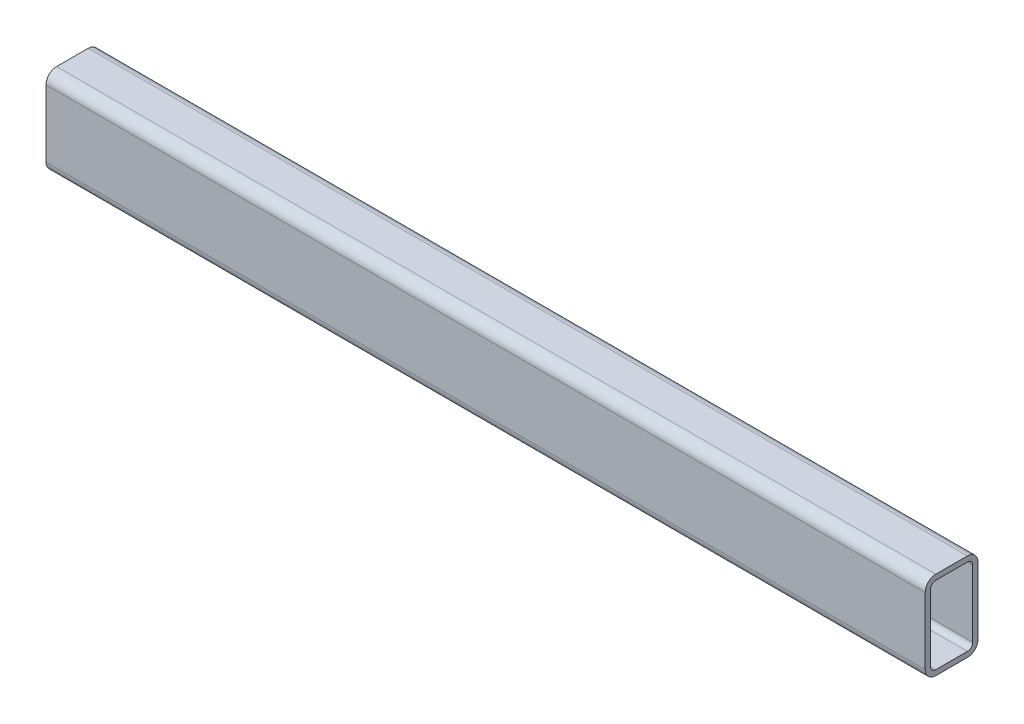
ISO-10303-21;
HEADER;
FILE_DESCRIPTION(('STEP AP214'),'2;1');
FILE_NAME('part.step','',(''),(''),'','','');
FILE_SCHEMA(('AUTOMOTIVE_DESIGN { 1 0 10303 214 1 1 1 1 }'));
ENDSEC;
DATA;
#1=APPLICATION_CONTEXT('core data for automotive mechanical design processes');
#2=APPLICATION_PROTOCOL_DEFINITION('international standard','automotive_design',2000,#1);
#3=PRODUCT_CONTEXT('',#1,'mechanical');
#4=PRODUCT('Part','Part','',(#3));
#5=PRODUCT_RELATED_PRODUCT_CATEGORY('part','',(#4));
#6=PRODUCT_DEFINITION_FORMATION('','',#4);
#7=PRODUCT_DEFINITION_CONTEXT('part definition',#1,'design');
#8=PRODUCT_DEFINITION('design','',#6,#7);
#9=PRODUCT_DEFINITION_SHAPE('','',#8);
#10=(LENGTH_UNIT() NAMED_UNIT(*) SI_UNIT(.MILLI.,.METRE.));
#11=(NAMED_UNIT(*) PLANE_ANGLE_UNIT() SI_UNIT($,.RADIAN.));
#12=(NAMED_UNIT(*) SI_UNIT($,.STERADIAN.) SOLID_ANGLE_UNIT());
#13=UNCERTAINTY_MEASURE_WITH_UNIT(LENGTH_MEASURE(1.E-05),#10,'distance_accuracy_value','');
#14=(GEOMETRIC_REPRESENTATION_CONTEXT(3) GLOBAL_UNCERTAINTY_ASSIGNED_CONTEXT((#13)) GLOBAL_UNIT_ASSIGNED_CONTEXT((#10,
#11,#12)) REPRESENTATION_CONTEXT('',''));
#15=CARTESIAN_POINT('',(0.,0.,0.));
#16=DIRECTION('',(0.,0.,1.));
#17=DIRECTION('',(1.,0.,0.));
#18=AXIS2_PLACEMENT_3D('',#15,#16,#17);
#19=CARTESIAN_POINT('',(250.,-19.,9.));
#20=DIRECTION('',(-1.,0.,0.));
#21=DIRECTION('',(0.,0.,1.));
#22=AXIS2_PLACEMENT_3D('',#19,#20,#21);
#23=CYLINDRICAL_SURFACE('',#22,3.);
#24=CARTESIAN_POINT('',(-250.,-19.,9.));
#25=DIRECTION('',(1.,0.,0.));
#26=DIRECTION('',(0.,0.,1.));
#27=AXIS2_PLACEMENT_3D('',#24,#25,#26);
#28=CIRCLE('',#27,3.);
#29=CARTESIAN_POINT('',(-250.,-19.,12.));
#30=VERTEX_POINT('',#29);
#31=CARTESIAN_POINT('',(-250.,-22.,9.));
#32=VERTEX_POINT('',#31);
#33=EDGE_CURVE('E189',#30,#32,#28,.T.);
#34=ORIENTED_EDGE('',*,*,#33,.F.);
#35=DIRECTION('',(-1.,0.,0.));
#36=VECTOR('',#35,1.);
#37=CARTESIAN_POINT('',(250.,-19.,12.));
#38=LINE('',#37,#36);
#39=CARTESIAN_POINT('',(250.,-19.,12.));
#40=VERTEX_POINT('',#39);
#41=EDGE_CURVE('E11',#40,#30,#38,.T.);
#42=ORIENTED_EDGE('',*,*,#41,.F.);
#43=CARTESIAN_POINT('',(250.,-19.,9.));
#44=DIRECTION('',(1.,0.,0.));
#45=DIRECTION('',(0.,0.,1.));
#46=AXIS2_PLACEMENT_3D('',#43,#44,#45);
#47=CIRCLE('',#46,3.);
#48=CARTESIAN_POINT('',(250.,-22.,9.));
#49=VERTEX_POINT('',#48);
#50=EDGE_CURVE('E228',#40,#49,#47,.T.);
#51=ORIENTED_EDGE('',*,*,#50,.T.);
#52=DIRECTION('',(-1.,0.,0.));
#53=VECTOR('',#52,1.);
#54=CARTESIAN_POINT('',(250.,-22.,9.));
#55=LINE('',#54,#53);
#56=EDGE_CURVE('E54',#49,#32,#55,.T.);
#57=ORIENTED_EDGE('',*,*,#56,.T.);
#58=EDGE_LOOP('',(#34,#42,#51,#57));
#59=FACE_BOUND('',#58,.T.);
#60=ADVANCED_FACE('F37',(#59),#23,.F.);
#61=CARTESIAN_POINT('',(250.,-19.,12.));
#62=DIRECTION('',(0.,0.,-1.));
#63=DIRECTION('',(-1.,0.,0.));
#64=AXIS2_PLACEMENT_3D('',#61,#62,#63);
#65=PLANE('',#64);
#66=DIRECTION('',(0.,-1.,0.));
#67=VECTOR('',#66,1.);
#68=CARTESIAN_POINT('',(-250.,-19.,12.));
#69=LINE('',#68,#67);
#70=CARTESIAN_POINT('',(-250.,19.,12.));
#71=VERTEX_POINT('',#70);
#72=EDGE_CURVE('E192',#71,#30,#69,.T.);
#73=ORIENTED_EDGE('',*,*,#72,.F.);
#74=DIRECTION('',(-1.,0.,0.));
#75=VECTOR('',#74,1.);
#76=CARTESIAN_POINT('',(250.,19.,12.));
#77=LINE('',#76,#75);
#78=CARTESIAN_POINT('',(250.,19.,12.));
#79=VERTEX_POINT('',#78);
#80=EDGE_CURVE('E46',#79,#71,#77,.T.);
#81=ORIENTED_EDGE('',*,*,#80,.F.);
#82=DIRECTION('',(0.,-1.,0.));
#83=VECTOR('',#82,1.);
#84=CARTESIAN_POINT('',(250.,-19.,12.));
#85=LINE('',#84,#83);
#86=EDGE_CURVE('E230',#79,#40,#85,.T.);
#87=ORIENTED_EDGE('',*,*,#86,.T.);
#88=ORIENTED_EDGE('',*,*,#41,.T.);
#89=EDGE_LOOP('',(#73,#81,#87,#88));
#90=FACE_BOUND('',#89,.T.);
#91=ADVANCED_FACE('F313',(#90),#65,.T.);
#92=CARTESIAN_POINT('',(250.,19.,9.00000000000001));
#93=DIRECTION('',(-1.,0.,0.));
#94=DIRECTION('',(0.,0.,1.));
#95=AXIS2_PLACEMENT_3D('',#92,#93,#94);
#96=CYLINDRICAL_SURFACE('',#95,2.99999999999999);
#97=CARTESIAN_POINT('',(-250.,19.,9.00000000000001));
#98=DIRECTION('',(1.,0.,0.));
#99=DIRECTION('',(0.,0.,1.));
#100=AXIS2_PLACEMENT_3D('',#97,#98,#99);
#101=CIRCLE('',#100,2.99999999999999);
#102=CARTESIAN_POINT('',(-250.,22.,9.));
#103=VERTEX_POINT('',#102);
#104=EDGE_CURVE('E195',#103,#71,#101,.T.);
#105=ORIENTED_EDGE('',*,*,#104,.F.);
#106=DIRECTION('',(-1.,0.,0.));
#107=VECTOR('',#106,1.);
#108=CARTESIAN_POINT('',(250.,22.,9.));
#109=LINE('',#108,#107);
#110=CARTESIAN_POINT('',(250.,22.,9.));
#111=VERTEX_POINT('',#110);
#112=EDGE_CURVE('E257',#111,#103,#109,.T.);
#113=ORIENTED_EDGE('',*,*,#112,.F.);
#114=CARTESIAN_POINT('',(250.,19.,9.00000000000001));
#115=DIRECTION('',(1.,0.,0.));
#116=DIRECTION('',(0.,0.,1.));
#117=AXIS2_PLACEMENT_3D('',#114,#115,#116);
#118=CIRCLE('',#117,2.99999999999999);
#119=EDGE_CURVE('E233',#111,#79,#118,.T.);
#120=ORIENTED_EDGE('',*,*,#119,.T.);
#121=ORIENTED_EDGE('',*,*,#80,.T.);
#122=EDGE_LOOP('',(#105,#113,#120,#121));
#123=FACE_BOUND('',#122,.T.);
#124=ADVANCED_FACE('F319',(#123),#96,.F.);
#125=CARTESIAN_POINT('',(250.,22.,9.));
#126=DIRECTION('',(0.,-1.,0.));
#127=DIRECTION('',(0.,0.,-1.));
#128=AXIS2_PLACEMENT_3D('',#125,#126,#127);
#129=PLANE('',#128);
#130=DIRECTION('',(0.,0.,1.));
#131=VECTOR('',#130,1.);
#132=CARTESIAN_POINT('',(-250.,22.,9.));
#133=LINE('',#132,#131);
#134=CARTESIAN_POINT('',(-250.,22.,-9.));
#135=VERTEX_POINT('',#134);
#136=EDGE_CURVE('E198',#135,#103,#133,.T.);
#137=ORIENTED_EDGE('',*,*,#136,.F.);
#138=DIRECTION('',(-1.,0.,0.));
#139=VECTOR('',#138,1.);
#140=CARTESIAN_POINT('',(250.,22.,-9.));
#141=LINE('',#140,#139);
#142=CARTESIAN_POINT('',(250.,22.,-9.));
#143=VERTEX_POINT('',#142);
#144=EDGE_CURVE('E255',#143,#135,#141,.T.);
#145=ORIENTED_EDGE('',*,*,#144,.F.);
#146=DIRECTION('',(0.,0.,1.));
#147=VECTOR('',#146,1.);
#148=CARTESIAN_POINT('',(250.,22.,9.));
#149=LINE('',#148,#147);
#150=EDGE_CURVE('E236',#143,#111,#149,.T.);
#151=ORIENTED_EDGE('',*,*,#150,.T.);
#152=ORIENTED_EDGE('',*,*,#112,.T.);
#153=EDGE_LOOP('',(#137,#145,#151,#152));
#154=FACE_BOUND('',#153,.T.);
#155=ADVANCED_FACE('F452',(#154),#129,.T.);
#156=CARTESIAN_POINT('',(250.,19.,-9.00000000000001));
#157=DIRECTION('',(-1.,0.,0.));
#158=DIRECTION('',(0.,0.,1.));
#159=AXIS2_PLACEMENT_3D('',#156,#157,#158);
#160=CYLINDRICAL_SURFACE('',#159,3.);
#161=CARTESIAN_POINT('',(-250.,19.,-9.00000000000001));
#162=DIRECTION('',(1.,0.,0.));
#163=DIRECTION('',(0.,0.,1.));
#164=AXIS2_PLACEMENT_3D('',#161,#162,#163);
#165=CIRCLE('',#164,3.);
#166=CARTESIAN_POINT('',(-250.,19.,-12.));
#167=VERTEX_POINT('',#166);
#168=EDGE_CURVE('E201',#167,#135,#165,.T.);
#169=ORIENTED_EDGE('',*,*,#168,.F.);
#170=DIRECTION('',(-1.,0.,0.));
#171=VECTOR('',#170,1.);
#172=CARTESIAN_POINT('',(250.,19.,-12.));
#173=LINE('',#172,#171);
#174=CARTESIAN_POINT('',(250.,19.,-12.));
#175=VERTEX_POINT('',#174);
#176=EDGE_CURVE('E253',#175,#167,#173,.T.);
#177=ORIENTED_EDGE('',*,*,#176,.F.);
#178=CARTESIAN_POINT('',(250.,19.,-9.00000000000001));
#179=DIRECTION('',(1.,0.,0.));
#180=DIRECTION('',(0.,0.,1.));
#181=AXIS2_PLACEMENT_3D('',#178,#179,#180);
#182=CIRCLE('',#181,3.);
#183=EDGE_CURVE('E239',#175,#143,#182,.T.);
#184=ORIENTED_EDGE('',*,*,#183,.T.);
#185=ORIENTED_EDGE('',*,*,#144,.T.);
#186=EDGE_LOOP('',(#169,#177,#184,#185));
#187=FACE_BOUND('',#186,.T.);
#188=ADVANCED_FACE('F441',(#187),#160,.F.);
#189=CARTESIAN_POINT('',(250.,-19.,-12.));
#190=DIRECTION('',(0.,0.,1.));
#191=DIRECTION('',(1.,0.,0.));
#192=AXIS2_PLACEMENT_3D('',#189,#190,#191);
#193=PLANE('',#192);
#194=DIRECTION('',(0.,1.,0.));
#195=VECTOR('',#194,1.);
#196=CARTESIAN_POINT('',(-250.,-19.,-12.));
#197=LINE('',#196,#195);
#198=CARTESIAN_POINT('',(-250.,-19.,-12.));
#199=VERTEX_POINT('',#198);
#200=EDGE_CURVE('E204',#199,#167,#197,.T.);
#201=ORIENTED_EDGE('',*,*,#200,.F.);
#202=DIRECTION('',(-1.,0.,0.));
#203=VECTOR('',#202,1.);
#204=CARTESIAN_POINT('',(250.,-19.,-12.));
#205=LINE('',#204,#203);
#206=CARTESIAN_POINT('',(250.,-19.,-12.));
#207=VERTEX_POINT('',#206);
#208=EDGE_CURVE('E251',#207,#199,#205,.T.);
#209=ORIENTED_EDGE('',*,*,#208,.F.);
#210=DIRECTION('',(0.,1.,0.));
#211=VECTOR('',#210,1.);
#212=CARTESIAN_POINT('',(250.,-19.,-12.));
#213=LINE('',#212,#211);
#214=EDGE_CURVE('E242',#207,#175,#213,.T.);
#215=ORIENTED_EDGE('',*,*,#214,.T.);
#216=ORIENTED_EDGE('',*,*,#176,.T.);
#217=EDGE_LOOP('',(#201,#209,#215,#216));
#218=FACE_BOUND('',#217,.T.);
#219=ADVANCED_FACE('F431',(#218),#193,.T.);
#220=CARTESIAN_POINT('',(250.,-19.,-9.00000000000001));
#221=DIRECTION('',(-1.,0.,0.));
#222=DIRECTION('',(0.,0.,1.));
#223=AXIS2_PLACEMENT_3D('',#220,#221,#222);
#224=CYLINDRICAL_SURFACE('',#223,3.);
#225=CARTESIAN_POINT('',(-250.,-19.,-9.00000000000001));
#226=DIRECTION('',(1.,0.,0.));
#227=DIRECTION('',(0.,0.,-1.));
#228=AXIS2_PLACEMENT_3D('',#225,#226,#227);
#229=CIRCLE('',#228,3.);
#230=CARTESIAN_POINT('',(-250.,-22.,-9.00000000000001));
#231=VERTEX_POINT('',#230);
#232=EDGE_CURVE('E207',#231,#199,#229,.T.);
#233=ORIENTED_EDGE('',*,*,#232,.F.);
#234=DIRECTION('',(-1.,0.,0.));
#235=VECTOR('',#234,1.);
#236=CARTESIAN_POINT('',(250.,-22.,-9.00000000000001));
#237=LINE('',#236,#235);
#238=CARTESIAN_POINT('',(250.,-22.,-9.00000000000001));
#239=VERTEX_POINT('',#238);
#240=EDGE_CURVE('E62',#239,#231,#237,.T.);
#241=ORIENTED_EDGE('',*,*,#240,.F.);
#242=CARTESIAN_POINT('',(250.,-19.,-9.00000000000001));
#243=DIRECTION('',(1.,0.,0.));
#244=DIRECTION('',(0.,0.,-1.));
#245=AXIS2_PLACEMENT_3D('',#242,#243,#244);
#246=CIRCLE('',#245,3.);
#247=EDGE_CURVE('E245',#239,#207,#246,.T.);
#248=ORIENTED_EDGE('',*,*,#247,.T.);
#249=ORIENTED_EDGE('',*,*,#208,.T.);
#250=EDGE_LOOP('',(#233,#241,#248,#249));
#251=FACE_BOUND('',#250,.T.);
#252=ADVANCED_FACE('F423',(#251),#224,.F.);
#253=CARTESIAN_POINT('',(250.,19.,9.00000000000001));
#254=DIRECTION('',(-1.,0.,0.));
#255=DIRECTION('',(0.,0.,1.));
#256=AXIS2_PLACEMENT_3D('',#253,#254,#255);
#257=CYLINDRICAL_SURFACE('',#256,6.);
#258=CARTESIAN_POINT('',(-250.,19.,9.00000000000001));
#259=DIRECTION('',(1.,0.,0.));
#260=DIRECTION('',(0.,0.,1.));
#261=AXIS2_PLACEMENT_3D('',#258,#259,#260);
#262=CIRCLE('',#261,6.);
#263=CARTESIAN_POINT('',(-250.,25.,9.));
#264=VERTEX_POINT('',#263);
#265=CARTESIAN_POINT('',(-250.,19.,15.));
#266=VERTEX_POINT('',#265);
#267=EDGE_CURVE('E159',#264,#266,#262,.T.);
#268=ORIENTED_EDGE('',*,*,#267,.T.);
#269=DIRECTION('',(-1.,0.,0.));
#270=VECTOR('',#269,1.);
#271=CARTESIAN_POINT('',(250.,19.,15.));
#272=LINE('',#271,#270);
#273=CARTESIAN_POINT('',(250.,19.,15.));
#274=VERTEX_POINT('',#273);
#275=EDGE_CURVE('E41',#274,#266,#272,.T.);
#276=ORIENTED_EDGE('',*,*,#275,.F.);
#277=CARTESIAN_POINT('',(250.,19.,9.00000000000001));
#278=DIRECTION('',(1.,0.,0.));
#279=DIRECTION('',(0.,0.,1.));
#280=AXIS2_PLACEMENT_3D('',#277,#278,#279);
#281=CIRCLE('',#280,6.);
#282=CARTESIAN_POINT('',(250.,25.,9.));
#283=VERTEX_POINT('',#282);
#284=EDGE_CURVE('E213',#283,#274,#281,.T.);
#285=ORIENTED_EDGE('',*,*,#284,.F.);
#286=DIRECTION('',(-1.,0.,0.));
#287=VECTOR('',#286,1.);
#288=CARTESIAN_POINT('',(250.,25.,9.));
#289=LINE('',#288,#287);
#290=EDGE_CURVE('E175',#283,#264,#289,.T.);
#291=ORIENTED_EDGE('',*,*,#290,.T.);
#292=EDGE_LOOP('',(#268,#276,#285,#291));
#293=FACE_BOUND('',#292,.T.);
#294=ADVANCED_FACE('F39',(#293),#257,.T.);
#295=CARTESIAN_POINT('',(250.,-19.,15.));
#296=DIRECTION('',(0.,0.,-1.));
#297=DIRECTION('',(0.,1.,0.));
#298=AXIS2_PLACEMENT_3D('',#295,#296,#297);
#299=PLANE('',#298);
#300=DIRECTION('',(0.,-1.,0.));
#301=VECTOR('',#300,1.);
#302=CARTESIAN_POINT('',(-250.,-19.,15.));
#303=LINE('',#302,#301);
#304=CARTESIAN_POINT('',(-250.,-19.,15.));
#305=VERTEX_POINT('',#304);
#306=EDGE_CURVE('E153',#266,#305,#303,.T.);
#307=ORIENTED_EDGE('',*,*,#306,.T.);
#308=DIRECTION('',(-1.,0.,0.));
#309=VECTOR('',#308,1.);
#310=CARTESIAN_POINT('',(250.,-19.,15.));
#311=LINE('',#310,#309);
#312=CARTESIAN_POINT('',(250.,-19.,15.));
#313=VERTEX_POINT('',#312);
#314=EDGE_CURVE('E172',#313,#305,#311,.T.);
#315=ORIENTED_EDGE('',*,*,#314,.F.);
#316=DIRECTION('',(0.,-1.,0.));
#317=VECTOR('',#316,1.);
#318=CARTESIAN_POINT('',(250.,-19.,15.));
#319=LINE('',#318,#317);
#320=EDGE_CURVE('E168',#274,#313,#319,.T.);
#321=ORIENTED_EDGE('',*,*,#320,.F.);
#322=ORIENTED_EDGE('',*,*,#275,.T.);
#323=EDGE_LOOP('',(#307,#315,#321,#322));
#324=FACE_BOUND('',#323,.T.);
#325=ADVANCED_FACE('F167',(#324),#299,.F.);
#326=CARTESIAN_POINT('',(250.,-19.,9.));
#327=DIRECTION('',(-1.,0.,0.));
#328=DIRECTION('',(0.,0.,1.));
#329=AXIS2_PLACEMENT_3D('',#326,#327,#328);
#330=CYLINDRICAL_SURFACE('',#329,6.);
#331=CARTESIAN_POINT('',(-250.,-19.,9.));
#332=DIRECTION('',(1.,0.,0.));
#333=DIRECTION('',(0.,0.,1.));
#334=AXIS2_PLACEMENT_3D('',#331,#332,#333);
#335=CIRCLE('',#334,6.);
#336=CARTESIAN_POINT('',(-250.,-25.,8.99999999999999));
#337=VERTEX_POINT('',#336);
#338=EDGE_CURVE('E161',#305,#337,#335,.T.);
#339=ORIENTED_EDGE('',*,*,#338,.T.);
#340=DIRECTION('',(-1.,0.,0.));
#341=VECTOR('',#340,1.);
#342=CARTESIAN_POINT('',(250.,-25.,8.99999999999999));
#343=LINE('',#342,#341);
#344=CARTESIAN_POINT('',(250.,-25.,8.99999999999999));
#345=VERTEX_POINT('',#344);
#346=EDGE_CURVE('E273',#345,#337,#343,.T.);
#347=ORIENTED_EDGE('',*,*,#346,.F.);
#348=CARTESIAN_POINT('',(250.,-19.,9.));
#349=DIRECTION('',(1.,0.,0.));
#350=DIRECTION('',(0.,0.,1.));
#351=AXIS2_PLACEMENT_3D('',#348,#349,#350);
#352=CIRCLE('',#351,6.);
#353=EDGE_CURVE('E216',#313,#345,#352,.T.);
#354=ORIENTED_EDGE('',*,*,#353,.F.);
#355=ORIENTED_EDGE('',*,*,#314,.T.);
#356=EDGE_LOOP('',(#339,#347,#354,#355));
#357=FACE_BOUND('',#356,.T.);
#358=ADVANCED_FACE('F277',(#357),#330,.T.);
#359=CARTESIAN_POINT('',(250.,-25.,9.));
#360=DIRECTION('',(0.,1.,0.));
#361=DIRECTION('',(0.,0.,1.));
#362=AXIS2_PLACEMENT_3D('',#359,#360,#361);
#363=PLANE('',#362);
#364=DIRECTION('',(0.,0.,-1.));
#365=VECTOR('',#364,1.);
#366=CARTESIAN_POINT('',(-250.,-25.,9.));
#367=LINE('',#366,#365);
#368=CARTESIAN_POINT('',(-250.,-25.,-9.));
#369=VERTEX_POINT('',#368);
#370=EDGE_CURVE('E179',#337,#369,#367,.T.);
#371=ORIENTED_EDGE('',*,*,#370,.T.);
#372=DIRECTION('',(-1.,0.,0.));
#373=VECTOR('',#372,1.);
#374=CARTESIAN_POINT('',(250.,-25.,-9.));
#375=LINE('',#374,#373);
#376=CARTESIAN_POINT('',(250.,-25.,-9.));
#377=VERTEX_POINT('',#376);
#378=EDGE_CURVE('E270',#377,#369,#375,.T.);
#379=ORIENTED_EDGE('',*,*,#378,.F.);
#380=DIRECTION('',(0.,0.,-1.));
#381=VECTOR('',#380,1.);
#382=CARTESIAN_POINT('',(250.,-25.,9.));
#383=LINE('',#382,#381);
#384=EDGE_CURVE('E218',#345,#377,#383,.T.);
#385=ORIENTED_EDGE('',*,*,#384,.F.);
#386=ORIENTED_EDGE('',*,*,#346,.T.);
#387=EDGE_LOOP('',(#371,#379,#385,#386));
#388=FACE_BOUND('',#387,.T.);
#389=ADVANCED_FACE('F303',(#388),#363,.F.);
#390=CARTESIAN_POINT('',(250.,-19.,-9.00000000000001));
#391=DIRECTION('',(-1.,0.,0.));
#392=DIRECTION('',(0.,0.,1.));
#393=AXIS2_PLACEMENT_3D('',#390,#391,#392);
#394=CYLINDRICAL_SURFACE('',#393,6.);
#395=CARTESIAN_POINT('',(-250.,-19.,-9.00000000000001));
#396=DIRECTION('',(1.,0.,0.));
#397=DIRECTION('',(0.,0.,-1.));
#398=AXIS2_PLACEMENT_3D('',#395,#396,#397);
#399=CIRCLE('',#398,6.);
#400=CARTESIAN_POINT('',(-250.,-19.,-15.));
#401=VERTEX_POINT('',#400);
#402=EDGE_CURVE('E181',#369,#401,#399,.T.);
#403=ORIENTED_EDGE('',*,*,#402,.T.);
#404=DIRECTION('',(-1.,0.,0.));
#405=VECTOR('',#404,1.);
#406=CARTESIAN_POINT('',(250.,-19.,-15.));
#407=LINE('',#406,#405);
#408=CARTESIAN_POINT('',(250.,-19.,-15.));
#409=VERTEX_POINT('',#408);
#410=EDGE_CURVE('E267',#409,#401,#407,.T.);
#411=ORIENTED_EDGE('',*,*,#410,.F.);
#412=CARTESIAN_POINT('',(250.,-19.,-9.00000000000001));
#413=DIRECTION('',(1.,0.,0.));
#414=DIRECTION('',(0.,0.,-1.));
#415=AXIS2_PLACEMENT_3D('',#412,#413,#414);
#416=CIRCLE('',#415,6.);
#417=EDGE_CURVE('E220',#377,#409,#416,.T.);
#418=ORIENTED_EDGE('',*,*,#417,.F.);
#419=ORIENTED_EDGE('',*,*,#378,.T.);
#420=EDGE_LOOP('',(#403,#411,#418,#419));
#421=FACE_BOUND('',#420,.T.);
#422=ADVANCED_FACE('F301',(#421),#394,.T.);
#423=CARTESIAN_POINT('',(250.,-19.,-15.));
#424=DIRECTION('',(0.,0.,1.));
#425=DIRECTION('',(1.,0.,0.));
#426=AXIS2_PLACEMENT_3D('',#423,#424,#425);
#427=PLANE('',#426);
#428=DIRECTION('',(0.,1.,0.));
#429=VECTOR('',#428,1.);
#430=CARTESIAN_POINT('',(-250.,-19.,-15.));
#431=LINE('',#430,#429);
#432=CARTESIAN_POINT('',(-250.,19.,-15.));
#433=VERTEX_POINT('',#432);
#434=EDGE_CURVE('E183',#401,#433,#431,.T.);
#435=ORIENTED_EDGE('',*,*,#434,.T.);
#436=DIRECTION('',(-1.,0.,0.));
#437=VECTOR('',#436,1.);
#438=CARTESIAN_POINT('',(250.,19.,-15.));
#439=LINE('',#438,#437);
#440=CARTESIAN_POINT('',(250.,19.,-15.));
#441=VERTEX_POINT('',#440);
#442=EDGE_CURVE('E264',#441,#433,#439,.T.);
#443=ORIENTED_EDGE('',*,*,#442,.F.);
#444=DIRECTION('',(0.,1.,0.));
#445=VECTOR('',#444,1.);
#446=CARTESIAN_POINT('',(250.,-19.,-15.));
#447=LINE('',#446,#445);
#448=EDGE_CURVE('E222',#409,#441,#447,.T.);
#449=ORIENTED_EDGE('',*,*,#448,.F.);
#450=ORIENTED_EDGE('',*,*,#410,.T.);
#451=EDGE_LOOP('',(#435,#443,#449,#450));
#452=FACE_BOUND('',#451,.T.);
#453=ADVANCED_FACE('F297',(#452),#427,.F.);
#454=CARTESIAN_POINT('',(250.,19.,-9.00000000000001));
#455=DIRECTION('',(-1.,0.,0.));
#456=DIRECTION('',(0.,0.,1.));
#457=AXIS2_PLACEMENT_3D('',#454,#455,#456);
#458=CYLINDRICAL_SURFACE('',#457,6.);
#459=CARTESIAN_POINT('',(-250.,19.,-9.00000000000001));
#460=DIRECTION('',(1.,0.,0.));
#461=DIRECTION('',(0.,0.,1.));
#462=AXIS2_PLACEMENT_3D('',#459,#460,#461);
#463=CIRCLE('',#462,6.);
#464=CARTESIAN_POINT('',(-250.,25.,-9.));
#465=VERTEX_POINT('',#464);
#466=EDGE_CURVE('E185',#433,#465,#463,.T.);
#467=ORIENTED_EDGE('',*,*,#466,.T.);
#468=DIRECTION('',(-1.,0.,0.));
#469=VECTOR('',#468,1.);
#470=CARTESIAN_POINT('',(250.,25.,-9.));
#471=LINE('',#470,#469);
#472=CARTESIAN_POINT('',(250.,25.,-9.));
#473=VERTEX_POINT('',#472);
#474=EDGE_CURVE('E261',#473,#465,#471,.T.);
#475=ORIENTED_EDGE('',*,*,#474,.F.);
#476=CARTESIAN_POINT('',(250.,19.,-9.00000000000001));
#477=DIRECTION('',(1.,0.,0.));
#478=DIRECTION('',(0.,0.,1.));
#479=AXIS2_PLACEMENT_3D('',#476,#477,#478);
#480=CIRCLE('',#479,6.);
#481=EDGE_CURVE('E224',#441,#473,#480,.T.);
#482=ORIENTED_EDGE('',*,*,#481,.F.);
#483=ORIENTED_EDGE('',*,*,#442,.T.);
#484=EDGE_LOOP('',(#467,#475,#482,#483));
#485=FACE_BOUND('',#484,.T.);
#486=ADVANCED_FACE('F293',(#485),#458,.T.);
#487=CARTESIAN_POINT('',(250.,25.,9.));
#488=DIRECTION('',(0.,-1.,0.));
#489=DIRECTION('',(0.,0.,-1.));
#490=AXIS2_PLACEMENT_3D('',#487,#488,#489);
#491=PLANE('',#490);
#492=DIRECTION('',(0.,0.,1.));
#493=VECTOR('',#492,1.);
#494=CARTESIAN_POINT('',(-250.,25.,9.));
#495=LINE('',#494,#493);
#496=EDGE_CURVE('E187',#465,#264,#495,.T.);
#497=ORIENTED_EDGE('',*,*,#496,.T.);
#498=ORIENTED_EDGE('',*,*,#290,.F.);
#499=DIRECTION('',(0.,0.,1.));
#500=VECTOR('',#499,1.);
#501=CARTESIAN_POINT('',(250.,25.,9.));
#502=LINE('',#501,#500);
#503=EDGE_CURVE('E226',#473,#283,#502,.T.);
#504=ORIENTED_EDGE('',*,*,#503,.F.);
#505=ORIENTED_EDGE('',*,*,#474,.T.);
#506=EDGE_LOOP('',(#497,#498,#504,#505));
#507=FACE_BOUND('',#506,.T.);
#508=ADVANCED_FACE('F288',(#507),#491,.F.);
#509=CARTESIAN_POINT('',(250.,-22.,9.));
#510=DIRECTION('',(0.,1.,0.));
#511=DIRECTION('',(0.,0.,1.));
#512=AXIS2_PLACEMENT_3D('',#509,#510,#511);
#513=PLANE('',#512);
#514=DIRECTION('',(0.,0.,-1.));
#515=VECTOR('',#514,1.);
#516=CARTESIAN_POINT('',(-250.,-22.,9.));
#517=LINE('',#516,#515);
#518=EDGE_CURVE('E210',#32,#231,#517,.T.);
#519=ORIENTED_EDGE('',*,*,#518,.F.);
#520=ORIENTED_EDGE('',*,*,#56,.F.);
#521=DIRECTION('',(0.,0.,-1.));
#522=VECTOR('',#521,1.);
#523=CARTESIAN_POINT('',(250.,-22.,9.));
#524=LINE('',#523,#522);
#525=EDGE_CURVE('E247',#49,#239,#524,.T.);
#526=ORIENTED_EDGE('',*,*,#525,.T.);
#527=ORIENTED_EDGE('',*,*,#240,.T.);
#528=EDGE_LOOP('',(#519,#520,#526,#527));
#529=FACE_BOUND('',#528,.T.);
#530=ADVANCED_FACE('F327',(#529),#513,.T.);
#531=CARTESIAN_POINT('',(250.,19.,9.00000000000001));
#532=DIRECTION('',(-1.,0.,0.));
#533=DIRECTION('',(0.,0.,1.));
#534=AXIS2_PLACEMENT_3D('',#531,#532,#533);
#535=PLANE('',#534);
#536=ORIENTED_EDGE('',*,*,#284,.T.);
#537=ORIENTED_EDGE('',*,*,#320,.T.);
#538=ORIENTED_EDGE('',*,*,#353,.T.);
#539=ORIENTED_EDGE('',*,*,#384,.T.);
#540=ORIENTED_EDGE('',*,*,#417,.T.);
#541=ORIENTED_EDGE('',*,*,#448,.T.);
#542=ORIENTED_EDGE('',*,*,#481,.T.);
#543=ORIENTED_EDGE('',*,*,#503,.T.);
#544=EDGE_LOOP('',(#536,#537,#538,#539,#540,#541,#542,#543));
#545=FACE_BOUND('',#544,.T.);
#546=ORIENTED_EDGE('',*,*,#50,.F.);
#547=ORIENTED_EDGE('',*,*,#86,.F.);
#548=ORIENTED_EDGE('',*,*,#119,.F.);
#549=ORIENTED_EDGE('',*,*,#150,.F.);
#550=ORIENTED_EDGE('',*,*,#183,.F.);
#551=ORIENTED_EDGE('',*,*,#214,.F.);
#552=ORIENTED_EDGE('',*,*,#247,.F.);
#553=ORIENTED_EDGE('',*,*,#525,.F.);
#554=EDGE_LOOP('',(#546,#547,#548,#549,#550,#551,#552,#553));
#555=FACE_BOUND('',#554,.T.);
#556=ADVANCED_FACE('F281',(#545,#555),#535,.F.);
#557=CARTESIAN_POINT('',(-250.,19.,9.00000000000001));
#558=DIRECTION('',(-1.,0.,0.));
#559=DIRECTION('',(0.,0.,1.));
#560=AXIS2_PLACEMENT_3D('',#557,#558,#559);
#561=PLANE('',#560);
#562=ORIENTED_EDGE('',*,*,#267,.F.);
#563=ORIENTED_EDGE('',*,*,#496,.F.);
#564=ORIENTED_EDGE('',*,*,#466,.F.);
#565=ORIENTED_EDGE('',*,*,#434,.F.);
#566=ORIENTED_EDGE('',*,*,#402,.F.);
#567=ORIENTED_EDGE('',*,*,#370,.F.);
#568=ORIENTED_EDGE('',*,*,#338,.F.);
#569=ORIENTED_EDGE('',*,*,#306,.F.);
#570=EDGE_LOOP('',(#562,#563,#564,#565,#566,#567,#568,#569));
#571=FACE_BOUND('',#570,.T.);
#572=ORIENTED_EDGE('',*,*,#33,.T.);
#573=ORIENTED_EDGE('',*,*,#518,.T.);
#574=ORIENTED_EDGE('',*,*,#232,.T.);
#575=ORIENTED_EDGE('',*,*,#200,.T.);
#576=ORIENTED_EDGE('',*,*,#168,.T.);
#577=ORIENTED_EDGE('',*,*,#136,.T.);
#578=ORIENTED_EDGE('',*,*,#104,.T.);
#579=ORIENTED_EDGE('',*,*,#72,.T.);
#580=EDGE_LOOP('',(#572,#573,#574,#575,#576,#577,#578,#579));
#581=FACE_BOUND('',#580,.T.);
#582=ADVANCED_FACE('F155',(#571,#581),#561,.T.);
#583=CLOSED_SHELL('',(#60,#91,#124,#155,#188,#219,#252,#294,#325,#358,#389,#422,#453,#486,#508,
#530,#556,#582));
#584=MANIFOLD_SOLID_BREP('B2',#583);
#585=ADVANCED_BREP_SHAPE_REPRESENTATION('',(#18,#584),#14);
#586=SHAPE_DEFINITION_REPRESENTATION(#9,#585);
ENDSEC;
END-ISO-10303-21;
